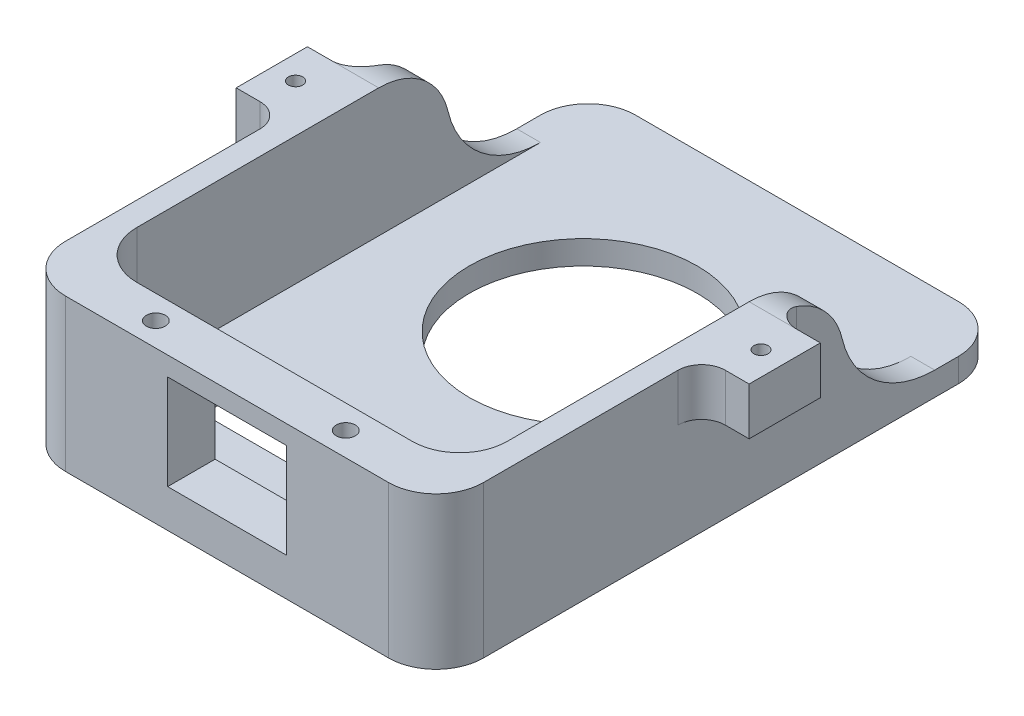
from build123d import *

# Parameters (mm, degrees)
ESQUISSE1_W             = 88
ESQUISSE1_H             = 120
BOSS_EXTRU_1_DEPTH      = 5
BOSS_EXTRU_2_DEPTH      = 27
CONG_3_R                = 10
ESQUISSE3_W             = 25
ESQUISSE3_H             = 20
ENL_V_MAT_EXTRU_1_DEPTH = 132.757352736
ESQUISSE6_R             = 24
ENL_V_MAT_EXTRU_2_DEPTH = 132.757352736
ESQUISSE7_W             = 35
ESQUISSE7_H             = 27
ENL_V_MAT_EXTRU_3_DEPTH = 27
CONG_6_R                = 20
CONG_7_R                = 15
ESQUISSE8_W             = 35
ESQUISSE8_H             = 27
ENL_V_MAT_EXTRU_4_DEPTH = 27
CONG_8_R                = 20
CONG_9_R                = 15
ESQUISSE12_W            = 60
ESQUISSE12_H            = 15
ENL_V_MAT_EXTRU_6_DEPTH = 15
CONG_12_R               = 5
ESQUISSE14_R            = 2
ENL_V_MAT_EXTRU_7_DEPTH = 132.757352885
CHANFREIN1_SIZE         = 2.5
CONG_13_R               = 10
ESQUISSE21_W            = 15
ESQUISSE21_H            = 10
BOSS_EXTRU_3_DEPTH      = 10
ESQUISSE22_W            = 15
ESQUISSE22_H            = 10
BOSS_EXTRU_4_DEPTH      = 10
ESQUISSE23_R            = 1.5
ENL_V_MAT_EXTRU_8_DEPTH = 136.42525629
CONG_14_R               = 5
CONG_15_R               = 10
CHANFREIN2_SIZE         = 2


with BuildPart() as part:
    # Esquisse1 → Boss.-Extru.1 (new body)
    with BuildSketch(Plane(origin=(0, 0, 0), x_dir=(1, 0, 0), z_dir=(0, 1, 0))):
        with Locations((0, 60)):
            Rectangle(ESQUISSE1_W, ESQUISSE1_H)
    extrude(amount=BOSS_EXTRU_1_DEPTH)

    # Esquisse2 → Boss.-Extru.2 (add)
    with BuildSketch(Plane(origin=(0, 5, 0), x_dir=(1, 0, 0), z_dir=(0, 1, 0))):
        Polygon((-39, 120), (-39, 10), (39, 10), (39, 120), (44, 120), (44, 0), (-44, 0), (-44, 120), align=None)
    extrude(amount=BOSS_EXTRU_2_DEPTH)

    # Cong_3
    cong_3_edges = [part.edges().sort_by_distance(p)[0] for p in [
        (39, 18.5, -10),
        (-39, 18.5, -10),
    ]]
    fillet(cong_3_edges, radius=CONG_3_R)

    # Esquisse3 → Enl_v. mat.-Extru.1 (cut, through all)
    with BuildSketch(Plane.XY):
        with Locations((0, 18)):
            Rectangle(ESQUISSE3_W, ESQUISSE3_H)
    extrude(amount=-ENL_V_MAT_EXTRU_1_DEPTH, mode=Mode.SUBTRACT)

    # Esquisse6 → Enl_v. mat.-Extru.2 (cut, through all)
    with BuildSketch(Plane.XZ):
        with Locations(Location((0, -75, 0), (0, 0, 270))):
            Circle(ESQUISSE6_R)
    extrude(amount=-ENL_V_MAT_EXTRU_2_DEPTH, mode=Mode.SUBTRACT)

    # Esquisse7 → Enl_v. mat.-Extru.3 (cut)
    with BuildSketch(Plane.ZY.offset(-39)):
        with Locations((-102.5, 18.5)):
            Rectangle(ESQUISSE7_W, ESQUISSE7_H)
    extrude(amount=-ENL_V_MAT_EXTRU_3_DEPTH, mode=Mode.SUBTRACT)

    # Cong_6
    cong_6_edges = [part.edges().sort_by_distance(p)[0] for p in [
        (41.5, 5, -85),
    ]]
    fillet(cong_6_edges, radius=CONG_6_R)

    # Cong_7
    cong_7_edges = [part.edges().sort_by_distance(p)[0] for p in [
        (41.5, 32, -85),
    ]]
    fillet(cong_7_edges, radius=CONG_7_R)

    # Esquisse8 → Enl_v. mat.-Extru.4 (cut)
    with BuildSketch(Plane(origin=(-39, 0, 0), x_dir=(0, 0, -1), z_dir=(1, 0, 0))):
        with Locations((102.5, 18.5)):
            Rectangle(ESQUISSE8_W, ESQUISSE8_H)
    extrude(amount=-ENL_V_MAT_EXTRU_4_DEPTH, mode=Mode.SUBTRACT)

    # Cong_8
    cong_8_edges = [part.edges().sort_by_distance(p)[0] for p in [
        (-41.5, 5, -85),
    ]]
    fillet(cong_8_edges, radius=CONG_8_R)

    # Cong_9
    cong_9_edges = [part.edges().sort_by_distance(p)[0] for p in [
        (-41.5, 32, -85),
    ]]
    fillet(cong_9_edges, radius=CONG_9_R)

    # Esquisse12 → Enl_v. mat.-Extru.6 (cut)
    with BuildSketch(Plane(origin=(0, 5, 0), x_dir=(1, 0, 0), z_dir=(0, 1, 0))):
        with Locations((0, 27.5)):
            Rectangle(ESQUISSE12_W, ESQUISSE12_H)
    extrude(amount=-ENL_V_MAT_EXTRU_6_DEPTH, mode=Mode.SUBTRACT)

    # Cong_12
    cong_12_edges = [part.edges().sort_by_distance(p)[0] for p in [
        (30, 2.5, -35),
        (30, 2.5, -20),
        (-30, 2.5, -20),
        (-30, 2.5, -35),
    ]]
    fillet(cong_12_edges, radius=CONG_12_R)

    # Esquisse14 → Enl_v. mat.-Extru.7 (cut, through all)
    with BuildSketch(Plane(origin=(0, 32, 0), x_dir=(1, 0, 0), z_dir=(0, 1, 0))):
        with Locations(Location((20, 5, 0), (0, 0, 270))):
            Circle(ESQUISSE14_R)
        with Locations(Location((-20, 5, 0), (0, 0, 270))):
            Circle(ESQUISSE14_R)
    extrude(amount=-ENL_V_MAT_EXTRU_7_DEPTH, mode=Mode.SUBTRACT)

    # Chanfrein1
    chanfrein1_edges = [part.edges().sort_by_distance(p)[0] for p in [
        (20, 0, -7),
        (-20, 0, -7),
    ]]
    chamfer(chanfrein1_edges, length=CHANFREIN1_SIZE)

    # Cong_13
    cong_13_edges = [part.edges().sort_by_distance(p)[0] for p in [
        (44, 16, 0),
        (-44, 16, 0),
    ]]
    fillet(cong_13_edges, radius=CONG_13_R)

    # Esquisse21 → Boss.-Extru.3 (add)
    with BuildSketch(Plane.ZY.offset(44)):
        with Locations((-63.426549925, 27)):
            Rectangle(ESQUISSE21_W, ESQUISSE21_H)
    extrude(amount=BOSS_EXTRU_3_DEPTH)

    # Esquisse22 → Boss.-Extru.4 (add)
    with BuildSketch(Plane(origin=(44, 0, 0), x_dir=(0, 0, -1), z_dir=(1, 0, 0))):
        with Locations((63.426549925, 27)):
            Rectangle(ESQUISSE22_W, ESQUISSE22_H)
    extrude(amount=BOSS_EXTRU_4_DEPTH)

    # Esquisse23 → Enl_v. mat.-Extru.8 (cut, through all)
    with BuildSketch(Plane(origin=(0, 32, 0), x_dir=(1, 0, 0), z_dir=(0, 1, 0))):
        with Locations(Location((49, 63.426549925, 0), (0, 0, 270))):
            Circle(ESQUISSE23_R)
        with Locations(Location((-49, 63.426549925, 0), (0, 0, 270))):
            Circle(ESQUISSE23_R)
    extrude(amount=-ENL_V_MAT_EXTRU_8_DEPTH, mode=Mode.SUBTRACT)

    # Cong_14
    cong_14_edges = [part.edges().sort_by_distance(p)[0] for p in [
        (-44, 27, -70.926549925),
        (-44, 27, -55.926549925),
        (44, 27, -70.926549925),
        (44, 27, -55.926549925),
    ]]
    fillet(cong_14_edges, radius=CONG_14_R)

    # Cong_15
    cong_15_edges = [part.edges().sort_by_distance(p)[0] for p in [
        (-44, 2.5, -120),
        (44, 2.5, -120),
    ]]
    fillet(cong_15_edges, radius=CONG_15_R)

    # Chanfrein2
    chanfrein2_edges = [part.edges().sort_by_distance(p)[0] for p in [
        (49, 22, -64.926549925),
        (-49, 22, -64.926549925),
    ]]
    chamfer(chanfrein2_edges, length=CHANFREIN2_SIZE)


solid = part.part
